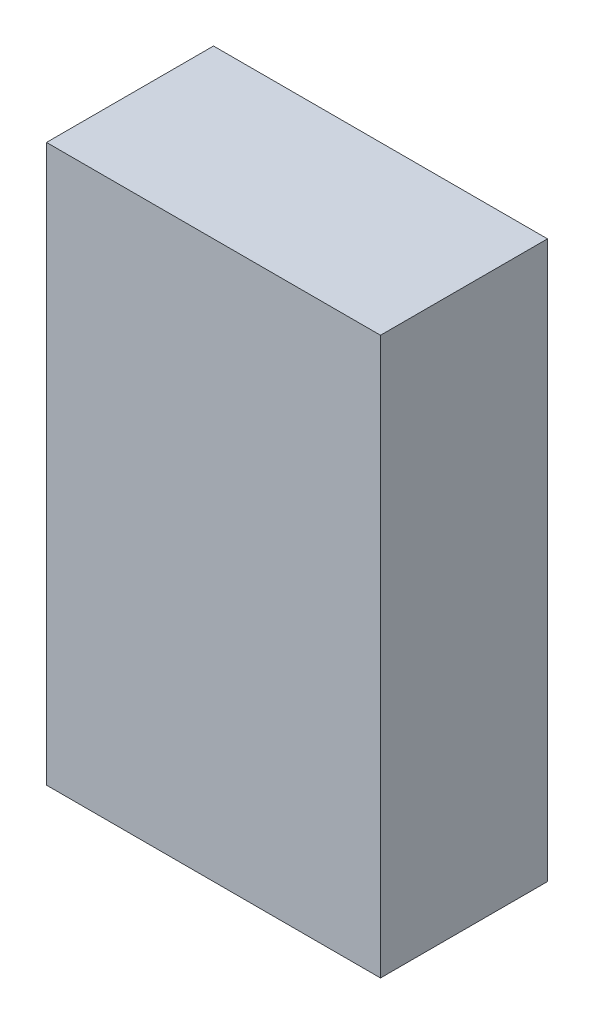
ISO-10303-21;
HEADER;
FILE_DESCRIPTION(('STEP AP214'),'2;1');
FILE_NAME('part.step','',(''),(''),'','','');
FILE_SCHEMA(('AUTOMOTIVE_DESIGN { 1 0 10303 214 1 1 1 1 }'));
ENDSEC;
DATA;
#1=APPLICATION_CONTEXT('core data for automotive mechanical design processes');
#2=APPLICATION_PROTOCOL_DEFINITION('international standard','automotive_design',2000,#1);
#3=PRODUCT_CONTEXT('',#1,'mechanical');
#4=PRODUCT('Part','Part','',(#3));
#5=PRODUCT_RELATED_PRODUCT_CATEGORY('part','',(#4));
#6=PRODUCT_DEFINITION_FORMATION('','',#4);
#7=PRODUCT_DEFINITION_CONTEXT('part definition',#1,'design');
#8=PRODUCT_DEFINITION('design','',#6,#7);
#9=PRODUCT_DEFINITION_SHAPE('','',#8);
#10=(LENGTH_UNIT() NAMED_UNIT(*) SI_UNIT(.MILLI.,.METRE.));
#11=(NAMED_UNIT(*) PLANE_ANGLE_UNIT() SI_UNIT($,.RADIAN.));
#12=(NAMED_UNIT(*) SI_UNIT($,.STERADIAN.) SOLID_ANGLE_UNIT());
#13=UNCERTAINTY_MEASURE_WITH_UNIT(LENGTH_MEASURE(1.E-05),#10,'distance_accuracy_value','');
#14=(GEOMETRIC_REPRESENTATION_CONTEXT(3) GLOBAL_UNCERTAINTY_ASSIGNED_CONTEXT((#13)) GLOBAL_UNIT_ASSIGNED_CONTEXT((#10,
#11,#12)) REPRESENTATION_CONTEXT('',''));
#15=CARTESIAN_POINT('',(0.,0.,0.));
#16=DIRECTION('',(0.,0.,1.));
#17=DIRECTION('',(1.,0.,0.));
#18=AXIS2_PLACEMENT_3D('',#15,#16,#17);
#19=CARTESIAN_POINT('',(-2.95,-0.6,1.305));
#20=DIRECTION('',(1.,0.,0.));
#21=DIRECTION('',(0.,0.,-1.));
#22=AXIS2_PLACEMENT_3D('',#19,#20,#21);
#23=PLANE('',#22);
#24=DIRECTION('',(0.,1.,0.));
#25=VECTOR('',#24,1.);
#26=CARTESIAN_POINT('',(-2.95,-0.6,1.605));
#27=LINE('',#26,#25);
#28=CARTESIAN_POINT('',(-2.95,-0.6,1.605));
#29=VERTEX_POINT('',#28);
#30=CARTESIAN_POINT('',(-2.95,0.4,1.605));
#31=VERTEX_POINT('',#30);
#32=EDGE_CURVE('E11',#29,#31,#27,.T.);
#33=ORIENTED_EDGE('',*,*,#32,.F.);
#34=DIRECTION('',(0.,0.,1.));
#35=VECTOR('',#34,1.);
#36=CARTESIAN_POINT('',(-2.95,-0.6,1.305));
#37=LINE('',#36,#35);
#38=CARTESIAN_POINT('',(-2.95,-0.6,1.305));
#39=VERTEX_POINT('',#38);
#40=EDGE_CURVE('E25',#39,#29,#37,.T.);
#41=ORIENTED_EDGE('',*,*,#40,.F.);
#42=DIRECTION('',(0.,1.,0.));
#43=VECTOR('',#42,1.);
#44=CARTESIAN_POINT('',(-2.95,-0.6,1.305));
#45=LINE('',#44,#43);
#46=CARTESIAN_POINT('',(-2.95,0.4,1.305));
#47=VERTEX_POINT('',#46);
#48=EDGE_CURVE('E94',#39,#47,#45,.T.);
#49=ORIENTED_EDGE('',*,*,#48,.T.);
#50=DIRECTION('',(0.,0.,1.));
#51=VECTOR('',#50,1.);
#52=CARTESIAN_POINT('',(-2.95,0.4,1.305));
#53=LINE('',#52,#51);
#54=EDGE_CURVE('E90',#47,#31,#53,.T.);
#55=ORIENTED_EDGE('',*,*,#54,.T.);
#56=EDGE_LOOP('',(#33,#41,#49,#55));
#57=FACE_BOUND('',#56,.T.);
#58=ADVANCED_FACE('F17',(#57),#23,.T.);
#59=CARTESIAN_POINT('',(-2.95,0.4,1.305));
#60=DIRECTION('',(0.,1.,0.));
#61=DIRECTION('',(0.,0.,1.));
#62=AXIS2_PLACEMENT_3D('',#59,#60,#61);
#63=PLANE('',#62);
#64=DIRECTION('',(-1.,0.,0.));
#65=VECTOR('',#64,1.);
#66=CARTESIAN_POINT('',(-2.95,0.4,1.605));
#67=LINE('',#66,#65);
#68=CARTESIAN_POINT('',(-3.55,0.4,1.605));
#69=VERTEX_POINT('',#68);
#70=EDGE_CURVE('E73',#31,#69,#67,.T.);
#71=ORIENTED_EDGE('',*,*,#70,.F.);
#72=ORIENTED_EDGE('',*,*,#54,.F.);
#73=DIRECTION('',(-1.,0.,0.));
#74=VECTOR('',#73,1.);
#75=CARTESIAN_POINT('',(-2.95,0.4,1.305));
#76=LINE('',#75,#74);
#77=CARTESIAN_POINT('',(-3.55,0.4,1.305));
#78=VERTEX_POINT('',#77);
#79=EDGE_CURVE('E76',#47,#78,#76,.T.);
#80=ORIENTED_EDGE('',*,*,#79,.T.);
#81=DIRECTION('',(0.,0.,1.));
#82=VECTOR('',#81,1.);
#83=CARTESIAN_POINT('',(-3.55,0.4,1.305));
#84=LINE('',#83,#82);
#85=EDGE_CURVE('E74',#78,#69,#84,.T.);
#86=ORIENTED_EDGE('',*,*,#85,.T.);
#87=EDGE_LOOP('',(#71,#72,#80,#86));
#88=FACE_BOUND('',#87,.T.);
#89=ADVANCED_FACE('F108',(#88),#63,.T.);
#90=CARTESIAN_POINT('',(-3.55,-0.6,1.305));
#91=DIRECTION('',(-1.,0.,0.));
#92=DIRECTION('',(0.,0.,1.));
#93=AXIS2_PLACEMENT_3D('',#90,#91,#92);
#94=PLANE('',#93);
#95=DIRECTION('',(0.,-1.,0.));
#96=VECTOR('',#95,1.);
#97=CARTESIAN_POINT('',(-3.55,-0.6,1.605));
#98=LINE('',#97,#96);
#99=CARTESIAN_POINT('',(-3.55,-0.6,1.605));
#100=VERTEX_POINT('',#99);
#101=EDGE_CURVE('E59',#69,#100,#98,.T.);
#102=ORIENTED_EDGE('',*,*,#101,.F.);
#103=ORIENTED_EDGE('',*,*,#85,.F.);
#104=DIRECTION('',(0.,-1.,0.));
#105=VECTOR('',#104,1.);
#106=CARTESIAN_POINT('',(-3.55,-0.6,1.305));
#107=LINE('',#106,#105);
#108=CARTESIAN_POINT('',(-3.55,-0.6,1.305));
#109=VERTEX_POINT('',#108);
#110=EDGE_CURVE('E62',#78,#109,#107,.T.);
#111=ORIENTED_EDGE('',*,*,#110,.T.);
#112=DIRECTION('',(0.,0.,1.));
#113=VECTOR('',#112,1.);
#114=CARTESIAN_POINT('',(-3.55,-0.6,1.305));
#115=LINE('',#114,#113);
#116=EDGE_CURVE('E54',#109,#100,#115,.T.);
#117=ORIENTED_EDGE('',*,*,#116,.T.);
#118=EDGE_LOOP('',(#102,#103,#111,#117));
#119=FACE_BOUND('',#118,.T.);
#120=ADVANCED_FACE('F56',(#119),#94,.T.);
#121=CARTESIAN_POINT('',(-2.95,-0.6,1.305));
#122=DIRECTION('',(0.,-1.,0.));
#123=DIRECTION('',(0.,0.,-1.));
#124=AXIS2_PLACEMENT_3D('',#121,#122,#123);
#125=PLANE('',#124);
#126=DIRECTION('',(1.,0.,0.));
#127=VECTOR('',#126,1.);
#128=CARTESIAN_POINT('',(-2.95,-0.6,1.605));
#129=LINE('',#128,#127);
#130=EDGE_CURVE('E65',#100,#29,#129,.T.);
#131=ORIENTED_EDGE('',*,*,#130,.F.);
#132=ORIENTED_EDGE('',*,*,#116,.F.);
#133=DIRECTION('',(1.,0.,0.));
#134=VECTOR('',#133,1.);
#135=CARTESIAN_POINT('',(-2.95,-0.6,1.305));
#136=LINE('',#135,#134);
#137=EDGE_CURVE('E69',#109,#39,#136,.T.);
#138=ORIENTED_EDGE('',*,*,#137,.T.);
#139=ORIENTED_EDGE('',*,*,#40,.T.);
#140=EDGE_LOOP('',(#131,#132,#138,#139));
#141=FACE_BOUND('',#140,.T.);
#142=ADVANCED_FACE('F67',(#141),#125,.T.);
#143=CARTESIAN_POINT('',(0.,0.,1.305));
#144=DIRECTION('',(0.,0.,1.));
#145=DIRECTION('',(1.,0.,0.));
#146=AXIS2_PLACEMENT_3D('',#143,#144,#145);
#147=PLANE('',#146);
#148=ORIENTED_EDGE('',*,*,#48,.F.);
#149=ORIENTED_EDGE('',*,*,#137,.F.);
#150=ORIENTED_EDGE('',*,*,#110,.F.);
#151=ORIENTED_EDGE('',*,*,#79,.F.);
#152=EDGE_LOOP('',(#148,#149,#150,#151));
#153=FACE_BOUND('',#152,.T.);
#154=ADVANCED_FACE('F106',(#153),#147,.F.);
#155=CARTESIAN_POINT('',(0.,0.,1.605));
#156=DIRECTION('',(0.,0.,1.));
#157=DIRECTION('',(1.,0.,0.));
#158=AXIS2_PLACEMENT_3D('',#155,#156,#157);
#159=PLANE('',#158);
#160=ORIENTED_EDGE('',*,*,#32,.T.);
#161=ORIENTED_EDGE('',*,*,#70,.T.);
#162=ORIENTED_EDGE('',*,*,#101,.T.);
#163=ORIENTED_EDGE('',*,*,#130,.T.);
#164=EDGE_LOOP('',(#160,#161,#162,#163));
#165=FACE_BOUND('',#164,.T.);
#166=ADVANCED_FACE('F71',(#165),#159,.T.);
#167=CLOSED_SHELL('',(#58,#89,#120,#142,#154,#166));
#168=MANIFOLD_SOLID_BREP('B1',#167);
#169=ADVANCED_BREP_SHAPE_REPRESENTATION('',(#18,#168),#14);
#170=SHAPE_DEFINITION_REPRESENTATION(#9,#169);
ENDSEC;
END-ISO-10303-21;
